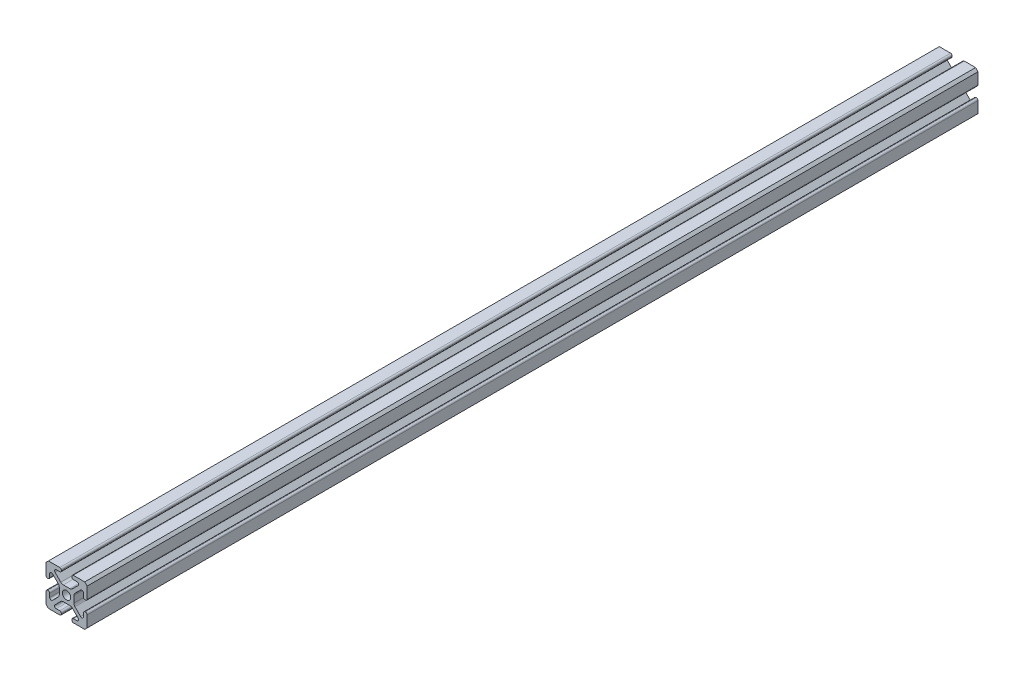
from build123d import *

# Parameters (mm, degrees)
BOSS_EXTRUDE1_DEPTH = 550


with BuildPart() as part:
    # Sketch1 → Boss-Extrude1 (new body)
    with BuildSketch(Plane.XY):
        with BuildLine():
            Line((-11.199951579, -12.7), (-4.222256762, -12.7))
            ThreePointArc((-4.222256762, -12.7), (-3.503836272, -12.40242049), (-3.206256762, -11.684))
            Line((-3.206256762, -11.684), (-3.206256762, -11.440665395))
            ThreePointArc((-3.206256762, -11.440665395), (-3.503836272, -10.722244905), (-4.222256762, -10.424665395))
            Line((-4.222256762, -10.424665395), (-6.40926672, -10.424665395))
            ThreePointArc((-6.40926672, -10.424665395), (-7.347928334, -9.797471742), (-7.127687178, -8.690244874))
            Line((-7.127687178, -8.690244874), (-3.593166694, -5.155724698))
            ThreePointArc((-3.593166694, -5.155724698), (-2.876257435, -4.67670128), (-2.030605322, -4.508490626))
            Line((-2.030605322, -4.508490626), (2.030598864, -4.508490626))
            ThreePointArc((2.030598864, -4.508490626), (2.876251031, -4.676701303), (3.593160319, -5.155724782))
            Line((3.593160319, -5.155724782), (7.127680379, -8.690244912))
            ThreePointArc((7.127680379, -8.690244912), (7.347921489, -9.019859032), (7.425259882, -9.408665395))
            ThreePointArc((7.425259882, -9.408665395), (7.127680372, -10.127085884), (6.409259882, -10.424665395))
            Line((6.409259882, -10.424665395), (4.22225065, -10.424665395))
            ThreePointArc((4.22225065, -10.424665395), (3.50383016, -10.722244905), (3.20625065, -11.440665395))
            Line((3.20625065, -11.440665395), (3.20625065, -11.684))
            ThreePointArc((3.20625065, -11.684), (3.50383016, -12.40242049), (4.22225065, -12.7))
            Line((4.22225065, -12.7), (11.199952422, -12.7))
            Line((11.199952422, -12.7), (12.7, -11.199951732))
            Line((12.7, -11.199951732), (12.7, -4.222256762))
            ThreePointArc((12.7, -4.222256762), (12.40242049, -3.503836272), (11.684, -3.206256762))
            Line((11.684, -3.206256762), (11.440665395, -3.206256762))
            ThreePointArc((11.440665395, -3.206256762), (10.722244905, -3.503836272), (10.424665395, -4.222256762))
            Line((10.424665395, -4.222256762), (10.424665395, -6.40926672))
            ThreePointArc((10.424665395, -6.40926672), (9.797471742, -7.347928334), (8.690244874, -7.127687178))
            Line((8.690244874, -7.127687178), (5.155724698, -3.593166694))
            ThreePointArc((5.155724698, -3.593166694), (4.67670128, -2.876257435), (4.508490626, -2.030605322))
            Line((4.508490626, -2.030605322), (4.508490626, 2.030598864))
            ThreePointArc((4.508490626, 2.030598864), (4.676701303, 2.876251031), (5.155724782, 3.593160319))
            Line((5.155724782, 3.593160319), (8.690244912, 7.127680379))
            ThreePointArc((8.690244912, 7.127680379), (9.019859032, 7.347921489), (9.408665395, 7.425259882))
            ThreePointArc((9.408665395, 7.425259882), (10.127085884, 7.127680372), (10.424665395, 6.409259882))
            Line((10.424665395, 6.409259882), (10.424665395, 4.22225065))
            ThreePointArc((10.424665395, 4.22225065), (10.722244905, 3.50383016), (11.440665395, 3.20625065))
            Line((11.440665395, 3.20625065), (11.684, 3.20625065))
            ThreePointArc((11.684, 3.20625065), (12.40242049, 3.50383016), (12.7, 4.22225065))
            Line((12.7, 4.22225065), (12.7, 11.199954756))
            Line((12.7, 11.199954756), (11.199954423, 12.7))
            Line((11.199954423, 12.7), (4.222256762, 12.7))
            ThreePointArc((4.222256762, 12.7), (3.503836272, 12.40242049), (3.206256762, 11.684))
            Line((3.206256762, 11.684), (3.206256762, 11.440665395))
            ThreePointArc((3.206256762, 11.440665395), (3.503836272, 10.722244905), (4.222256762, 10.424665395))
            Line((4.222256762, 10.424665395), (6.40926672, 10.424665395))
            ThreePointArc((6.40926672, 10.424665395), (7.347928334, 9.797471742), (7.127687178, 8.690244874))
            Line((7.127687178, 8.690244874), (3.593166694, 5.155724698))
            ThreePointArc((3.593166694, 5.155724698), (2.876257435, 4.67670128), (2.030605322, 4.508490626))
            Line((2.030605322, 4.508490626), (-2.030598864, 4.508490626))
            ThreePointArc((-2.030598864, 4.508490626), (-2.876251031, 4.676701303), (-3.593160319, 5.155724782))
            Line((-3.593160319, 5.155724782), (-7.127680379, 8.690244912))
            ThreePointArc((-7.127680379, 8.690244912), (-7.347921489, 9.019859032), (-7.425259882, 9.408665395))
            ThreePointArc((-7.425259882, 9.408665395), (-7.127680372, 10.127085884), (-6.409259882, 10.424665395))
            Line((-6.409259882, 10.424665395), (-4.22225065, 10.424665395))
            ThreePointArc((-4.22225065, 10.424665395), (-3.50383016, 10.722244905), (-3.20625065, 11.440665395))
            Line((-3.20625065, 11.440665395), (-3.20625065, 11.684))
            ThreePointArc((-3.20625065, 11.684), (-3.50383016, 12.40242049), (-4.22225065, 12.7))
            Line((-4.22225065, 12.7), (-11.199951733, 12.7))
            Line((-11.199951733, 12.7), (-12.7, 11.1999514))
            Line((-12.7, 11.1999514), (-12.7, 4.222256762))
            ThreePointArc((-12.7, 4.222256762), (-12.40242049, 3.503836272), (-11.684, 3.206256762))
            Line((-11.684, 3.206256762), (-11.440665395, 3.206256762))
            ThreePointArc((-11.440665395, 3.206256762), (-10.722244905, 3.503836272), (-10.424665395, 4.222256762))
            Line((-10.424665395, 4.222256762), (-10.424665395, 6.40926672))
            ThreePointArc((-10.424665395, 6.40926672), (-9.797471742, 7.347928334), (-8.690244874, 7.127687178))
            Line((-8.690244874, 7.127687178), (-5.155724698, 3.593166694))
            ThreePointArc((-5.155724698, 3.593166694), (-4.67670128, 2.876257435), (-4.508490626, 2.030605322))
            Line((-4.508490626, 2.030605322), (-4.508490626, -2.030598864))
            ThreePointArc((-4.508490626, -2.030598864), (-4.676701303, -2.876251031), (-5.155724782, -3.593160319))
            Line((-5.155724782, -3.593160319), (-8.690244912, -7.127680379))
            ThreePointArc((-8.690244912, -7.127680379), (-9.019859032, -7.347921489), (-9.408665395, -7.425259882))
            ThreePointArc((-9.408665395, -7.425259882), (-10.127085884, -7.127680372), (-10.424665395, -6.409259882))
            Line((-10.424665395, -6.409259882), (-10.424665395, -4.22225065))
            ThreePointArc((-10.424665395, -4.22225065), (-10.722244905, -3.50383016), (-11.440665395, -3.20625065))
            Line((-11.440665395, -3.20625065), (-11.684, -3.20625065))
            ThreePointArc((-11.684, -3.20625065), (-12.40242049, -3.50383016), (-12.7, -4.22225065))
            Line((-12.7, -4.22225065), (-12.7, -11.199952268))
            Line((-12.7, -11.199952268), (-11.199951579, -12.7))
        make_face()
        with BuildLine():
            ThreePointArc((-2.55499489, 0), (0, -2.55499489), (2.55499489, 0))
            ThreePointArc((2.55499489, 0), (0, 2.55499489), (-2.55499489, 0))
        make_face(mode=Mode.SUBTRACT)
    extrude(amount=BOSS_EXTRUDE1_DEPTH)


solid = part.part
